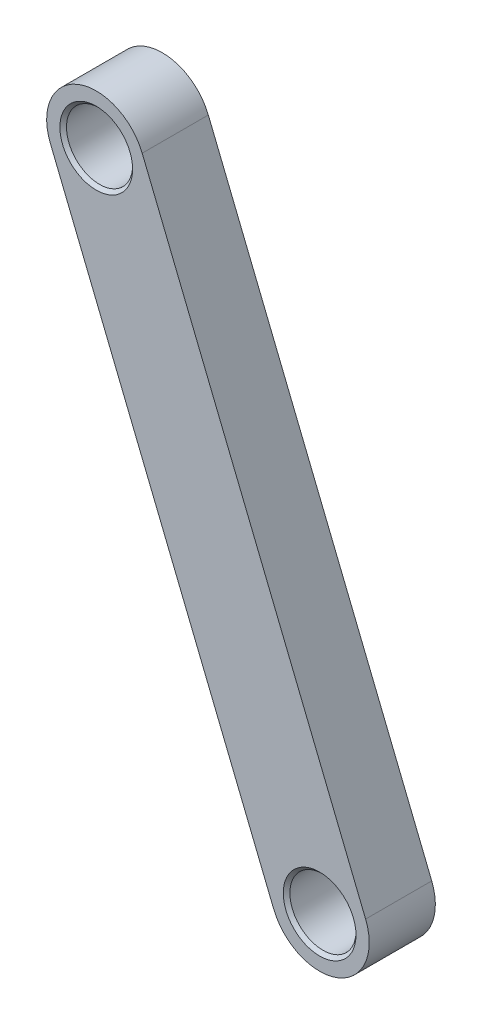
ISO-10303-21;
HEADER;
FILE_DESCRIPTION(('STEP AP214'),'2;1');
FILE_NAME('part.step','',(''),(''),'','','');
FILE_SCHEMA(('AUTOMOTIVE_DESIGN { 1 0 10303 214 1 1 1 1 }'));
ENDSEC;
DATA;
#1=APPLICATION_CONTEXT('core data for automotive mechanical design processes');
#2=APPLICATION_PROTOCOL_DEFINITION('international standard','automotive_design',2000,#1);
#3=PRODUCT_CONTEXT('',#1,'mechanical');
#4=PRODUCT('Part','Part','',(#3));
#5=PRODUCT_RELATED_PRODUCT_CATEGORY('part','',(#4));
#6=PRODUCT_DEFINITION_FORMATION('','',#4);
#7=PRODUCT_DEFINITION_CONTEXT('part definition',#1,'design');
#8=PRODUCT_DEFINITION('design','',#6,#7);
#9=PRODUCT_DEFINITION_SHAPE('','',#8);
#10=(LENGTH_UNIT() NAMED_UNIT(*) SI_UNIT(.MILLI.,.METRE.));
#11=(NAMED_UNIT(*) PLANE_ANGLE_UNIT() SI_UNIT($,.RADIAN.));
#12=(NAMED_UNIT(*) SI_UNIT($,.STERADIAN.) SOLID_ANGLE_UNIT());
#13=UNCERTAINTY_MEASURE_WITH_UNIT(LENGTH_MEASURE(1.E-05),#10,'distance_accuracy_value','');
#14=(GEOMETRIC_REPRESENTATION_CONTEXT(3) GLOBAL_UNCERTAINTY_ASSIGNED_CONTEXT((#13)) GLOBAL_UNIT_ASSIGNED_CONTEXT((#10,
#11,#12)) REPRESENTATION_CONTEXT('',''));
#15=CARTESIAN_POINT('',(0.,0.,0.));
#16=DIRECTION('',(0.,0.,1.));
#17=DIRECTION('',(1.,0.,0.));
#18=AXIS2_PLACEMENT_3D('',#15,#16,#17);
#19=CARTESIAN_POINT('',(61.7201647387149,127.884766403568,20.));
#20=DIRECTION('',(0.,0.,1.));
#21=DIRECTION('',(1.,0.,0.));
#22=AXIS2_PLACEMENT_3D('',#19,#20,#21);
#23=PLANE('',#22);
#24=CARTESIAN_POINT('',(-5.85208023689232,294.71998962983,20.));
#25=DIRECTION('',(0.,0.,1.));
#26=DIRECTION('',(1.,0.,0.));
#27=AXIS2_PLACEMENT_3D('',#24,#25,#26);
#28=CIRCLE('',#27,11.);
#29=CARTESIAN_POINT('',(5.14791976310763,294.71998962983,20.));
#30=VERTEX_POINT('',#29);
#31=EDGE_CURVE('E124',#30,#30,#28,.F.);
#32=ORIENTED_EDGE('',*,*,#31,.T.);
#33=EDGE_LOOP('',(#32));
#34=FACE_BOUND('',#33,.T.);
#35=CARTESIAN_POINT('',(61.7201647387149,127.884766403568,20.));
#36=DIRECTION('',(0.,0.,1.));
#37=DIRECTION('',(1.,0.,0.));
#38=AXIS2_PLACEMENT_3D('',#35,#36,#37);
#39=CIRCLE('',#38,11.);
#40=CARTESIAN_POINT('',(72.7201647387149,127.884766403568,20.));
#41=VERTEX_POINT('',#40);
#42=EDGE_CURVE('E121',#41,#41,#39,.F.);
#43=ORIENTED_EDGE('',*,*,#42,.T.);
#44=EDGE_LOOP('',(#43));
#45=FACE_BOUND('',#44,.T.);
#46=CARTESIAN_POINT('',(61.7201647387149,127.884766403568,20.));
#47=DIRECTION('',(0.,0.,1.));
#48=DIRECTION('',(1.,0.,0.));
#49=AXIS2_PLACEMENT_3D('',#46,#47,#48);
#50=CIRCLE('',#49,15.);
#51=CARTESIAN_POINT('',(47.8172294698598,122.253745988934,20.));
#52=VERTEX_POINT('',#51);
#53=CARTESIAN_POINT('',(75.62310000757,133.515786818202,20.));
#54=VERTEX_POINT('',#53);
#55=EDGE_CURVE('E85',#52,#54,#50,.T.);
#56=ORIENTED_EDGE('',*,*,#55,.T.);
#57=DIRECTION('',(-0.375401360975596,0.926862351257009,0.));
#58=VECTOR('',#57,1.);
#59=CARTESIAN_POINT('',(75.62310000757,133.515786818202,20.));
#60=LINE('',#59,#58);
#61=CARTESIAN_POINT('',(8.05085503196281,300.351010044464,20.));
#62=VERTEX_POINT('',#61);
#63=EDGE_CURVE('E81',#54,#62,#60,.T.);
#64=ORIENTED_EDGE('',*,*,#63,.T.);
#65=CARTESIAN_POINT('',(-5.85208023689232,294.71998962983,20.));
#66=DIRECTION('',(0.,0.,1.));
#67=DIRECTION('',(1.,0.,0.));
#68=AXIS2_PLACEMENT_3D('',#65,#66,#67);
#69=CIRCLE('',#68,15.);
#70=CARTESIAN_POINT('',(-19.7550155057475,289.088969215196,20.));
#71=VERTEX_POINT('',#70);
#72=EDGE_CURVE('E83',#62,#71,#69,.T.);
#73=ORIENTED_EDGE('',*,*,#72,.T.);
#74=DIRECTION('',(0.375401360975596,-0.926862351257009,0.));
#75=VECTOR('',#74,1.);
#76=CARTESIAN_POINT('',(47.8172294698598,122.253745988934,20.));
#77=LINE('',#76,#75);
#78=EDGE_CURVE('E50',#71,#52,#77,.T.);
#79=ORIENTED_EDGE('',*,*,#78,.T.);
#80=EDGE_LOOP('',(#56,#64,#73,#79));
#81=FACE_BOUND('',#80,.T.);
#82=ADVANCED_FACE('F33',(#34,#45,#81),#23,.T.);
#83=CARTESIAN_POINT('',(61.7201647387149,127.884766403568,0.));
#84=DIRECTION('',(0.,0.,1.));
#85=DIRECTION('',(1.,0.,0.));
#86=AXIS2_PLACEMENT_3D('',#83,#84,#85);
#87=PLANE('',#86);
#88=CARTESIAN_POINT('',(-5.85208023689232,294.71998962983,0.));
#89=DIRECTION('',(0.,0.,1.));
#90=DIRECTION('',(1.,0.,0.));
#91=AXIS2_PLACEMENT_3D('',#88,#89,#90);
#92=CIRCLE('',#91,11.);
#93=CARTESIAN_POINT('',(5.14791976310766,294.71998962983,0.));
#94=VERTEX_POINT('',#93);
#95=EDGE_CURVE('E112',#94,#94,#92,.T.);
#96=ORIENTED_EDGE('',*,*,#95,.T.);
#97=EDGE_LOOP('',(#96));
#98=FACE_BOUND('',#97,.T.);
#99=CARTESIAN_POINT('',(61.7201647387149,127.884766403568,0.));
#100=DIRECTION('',(0.,0.,1.));
#101=DIRECTION('',(1.,0.,0.));
#102=AXIS2_PLACEMENT_3D('',#99,#100,#101);
#103=CIRCLE('',#102,11.);
#104=CARTESIAN_POINT('',(72.7201647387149,127.884766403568,0.));
#105=VERTEX_POINT('',#104);
#106=EDGE_CURVE('E109',#105,#105,#103,.T.);
#107=ORIENTED_EDGE('',*,*,#106,.T.);
#108=EDGE_LOOP('',(#107));
#109=FACE_BOUND('',#108,.T.);
#110=CARTESIAN_POINT('',(61.7201647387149,127.884766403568,0.));
#111=DIRECTION('',(0.,0.,1.));
#112=DIRECTION('',(1.,0.,0.));
#113=AXIS2_PLACEMENT_3D('',#110,#111,#112);
#114=CIRCLE('',#113,15.);
#115=CARTESIAN_POINT('',(47.8172294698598,122.253745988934,0.));
#116=VERTEX_POINT('',#115);
#117=CARTESIAN_POINT('',(75.62310000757,133.515786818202,0.));
#118=VERTEX_POINT('',#117);
#119=EDGE_CURVE('E100',#116,#118,#114,.T.);
#120=ORIENTED_EDGE('',*,*,#119,.F.);
#121=DIRECTION('',(0.375401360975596,-0.926862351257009,0.));
#122=VECTOR('',#121,1.);
#123=CARTESIAN_POINT('',(47.8172294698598,122.253745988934,0.));
#124=LINE('',#123,#122);
#125=CARTESIAN_POINT('',(-19.7550155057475,289.088969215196,0.));
#126=VERTEX_POINT('',#125);
#127=EDGE_CURVE('E73',#126,#116,#124,.T.);
#128=ORIENTED_EDGE('',*,*,#127,.F.);
#129=CARTESIAN_POINT('',(-5.85208023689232,294.71998962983,0.));
#130=DIRECTION('',(0.,0.,1.));
#131=DIRECTION('',(1.,0.,0.));
#132=AXIS2_PLACEMENT_3D('',#129,#130,#131);
#133=CIRCLE('',#132,15.);
#134=CARTESIAN_POINT('',(8.05085503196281,300.351010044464,0.));
#135=VERTEX_POINT('',#134);
#136=EDGE_CURVE('E67',#135,#126,#133,.T.);
#137=ORIENTED_EDGE('',*,*,#136,.F.);
#138=DIRECTION('',(-0.375401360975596,0.926862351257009,0.));
#139=VECTOR('',#138,1.);
#140=CARTESIAN_POINT('',(75.62310000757,133.515786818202,0.));
#141=LINE('',#140,#139);
#142=EDGE_CURVE('E90',#118,#135,#141,.T.);
#143=ORIENTED_EDGE('',*,*,#142,.F.);
#144=EDGE_LOOP('',(#120,#128,#137,#143));
#145=FACE_BOUND('',#144,.T.);
#146=ADVANCED_FACE('F141',(#98,#109,#145),#87,.F.);
#147=CARTESIAN_POINT('',(61.7201647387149,127.884766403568,20.));
#148=DIRECTION('',(0.,0.,-1.));
#149=DIRECTION('',(-1.,0.,0.));
#150=AXIS2_PLACEMENT_3D('',#147,#148,#149);
#151=CYLINDRICAL_SURFACE('',#150,15.);
#152=ORIENTED_EDGE('',*,*,#119,.T.);
#153=DIRECTION('',(0.,0.,-1.));
#154=VECTOR('',#153,1.);
#155=CARTESIAN_POINT('',(75.62310000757,133.515786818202,20.));
#156=LINE('',#155,#154);
#157=EDGE_CURVE('E91',#54,#118,#156,.T.);
#158=ORIENTED_EDGE('',*,*,#157,.F.);
#159=ORIENTED_EDGE('',*,*,#55,.F.);
#160=DIRECTION('',(0.,0.,-1.));
#161=VECTOR('',#160,1.);
#162=CARTESIAN_POINT('',(47.8172294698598,122.253745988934,20.));
#163=LINE('',#162,#161);
#164=EDGE_CURVE('E96',#52,#116,#163,.T.);
#165=ORIENTED_EDGE('',*,*,#164,.T.);
#166=EDGE_LOOP('',(#152,#158,#159,#165));
#167=FACE_BOUND('',#166,.T.);
#168=ADVANCED_FACE('F147',(#167),#151,.T.);
#169=CARTESIAN_POINT('',(75.62310000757,133.515786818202,20.));
#170=DIRECTION('',(-0.926862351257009,-0.375401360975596,0.));
#171=DIRECTION('',(0.375401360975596,-0.926862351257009,0.));
#172=AXIS2_PLACEMENT_3D('',#169,#170,#171);
#173=PLANE('',#172);
#174=ORIENTED_EDGE('',*,*,#142,.T.);
#175=DIRECTION('',(0.,0.,-1.));
#176=VECTOR('',#175,1.);
#177=CARTESIAN_POINT('',(8.05085503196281,300.351010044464,20.));
#178=LINE('',#177,#176);
#179=EDGE_CURVE('E88',#62,#135,#178,.T.);
#180=ORIENTED_EDGE('',*,*,#179,.F.);
#181=ORIENTED_EDGE('',*,*,#63,.F.);
#182=ORIENTED_EDGE('',*,*,#157,.T.);
#183=EDGE_LOOP('',(#174,#180,#181,#182));
#184=FACE_BOUND('',#183,.T.);
#185=ADVANCED_FACE('F89',(#184),#173,.F.);
#186=CARTESIAN_POINT('',(-5.85208023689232,294.71998962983,20.));
#187=DIRECTION('',(0.,0.,-1.));
#188=DIRECTION('',(-1.,0.,0.));
#189=AXIS2_PLACEMENT_3D('',#186,#187,#188);
#190=CYLINDRICAL_SURFACE('',#189,15.);
#191=ORIENTED_EDGE('',*,*,#136,.T.);
#192=DIRECTION('',(0.,0.,-1.));
#193=VECTOR('',#192,1.);
#194=CARTESIAN_POINT('',(-19.7550155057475,289.088969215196,20.));
#195=LINE('',#194,#193);
#196=EDGE_CURVE('E92',#71,#126,#195,.T.);
#197=ORIENTED_EDGE('',*,*,#196,.F.);
#198=ORIENTED_EDGE('',*,*,#72,.F.);
#199=ORIENTED_EDGE('',*,*,#179,.T.);
#200=EDGE_LOOP('',(#191,#197,#198,#199));
#201=FACE_BOUND('',#200,.T.);
#202=ADVANCED_FACE('F94',(#201),#190,.T.);
#203=CARTESIAN_POINT('',(47.8172294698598,122.253745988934,20.));
#204=DIRECTION('',(0.926862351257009,0.375401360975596,0.));
#205=DIRECTION('',(-0.375401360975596,0.926862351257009,0.));
#206=AXIS2_PLACEMENT_3D('',#203,#204,#205);
#207=PLANE('',#206);
#208=ORIENTED_EDGE('',*,*,#127,.T.);
#209=ORIENTED_EDGE('',*,*,#164,.F.);
#210=ORIENTED_EDGE('',*,*,#78,.F.);
#211=ORIENTED_EDGE('',*,*,#196,.T.);
#212=EDGE_LOOP('',(#208,#209,#210,#211));
#213=FACE_BOUND('',#212,.T.);
#214=ADVANCED_FACE('F155',(#213),#207,.F.);
#215=CARTESIAN_POINT('',(-5.85208023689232,294.71998962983,20.));
#216=DIRECTION('',(0.,0.,-1.));
#217=DIRECTION('',(-1.,0.,0.));
#218=AXIS2_PLACEMENT_3D('',#215,#216,#217);
#219=CYLINDRICAL_SURFACE('',#218,10.);
#220=CARTESIAN_POINT('',(-5.85208023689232,294.71998962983,0.99999999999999));
#221=DIRECTION('',(0.,0.,1.));
#222=DIRECTION('',(1.,0.,0.));
#223=AXIS2_PLACEMENT_3D('',#220,#221,#222);
#224=CIRCLE('',#223,10.);
#225=CARTESIAN_POINT('',(4.14791976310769,294.71998962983,0.99999999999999));
#226=VERTEX_POINT('',#225);
#227=EDGE_CURVE('E118',#226,#226,#224,.F.);
#228=ORIENTED_EDGE('',*,*,#227,.T.);
#229=EDGE_LOOP('',(#228));
#230=FACE_BOUND('',#229,.T.);
#231=CARTESIAN_POINT('',(-5.85208023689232,294.71998962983,19.0000000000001));
#232=DIRECTION('',(0.,0.,1.));
#233=DIRECTION('',(1.,0.,0.));
#234=AXIS2_PLACEMENT_3D('',#231,#232,#233);
#235=CIRCLE('',#234,10.);
#236=CARTESIAN_POINT('',(4.14791976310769,294.71998962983,19.0000000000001));
#237=VERTEX_POINT('',#236);
#238=EDGE_CURVE('E115',#237,#237,#235,.T.);
#239=ORIENTED_EDGE('',*,*,#238,.T.);
#240=EDGE_LOOP('',(#239));
#241=FACE_BOUND('',#240,.T.);
#242=ADVANCED_FACE('F152',(#230,#241),#219,.F.);
#243=CARTESIAN_POINT('',(61.7201647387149,127.884766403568,20.));
#244=DIRECTION('',(0.,0.,-1.));
#245=DIRECTION('',(-1.,0.,0.));
#246=AXIS2_PLACEMENT_3D('',#243,#244,#245);
#247=CYLINDRICAL_SURFACE('',#246,10.);
#248=CARTESIAN_POINT('',(61.7201647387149,127.884766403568,0.999999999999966));
#249=DIRECTION('',(0.,0.,1.));
#250=DIRECTION('',(1.,0.,0.));
#251=AXIS2_PLACEMENT_3D('',#248,#249,#250);
#252=CIRCLE('',#251,10.);
#253=CARTESIAN_POINT('',(71.7201647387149,127.884766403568,0.999999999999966));
#254=VERTEX_POINT('',#253);
#255=EDGE_CURVE('E11',#254,#254,#252,.F.);
#256=ORIENTED_EDGE('',*,*,#255,.T.);
#257=EDGE_LOOP('',(#256));
#258=FACE_BOUND('',#257,.T.);
#259=CARTESIAN_POINT('',(61.7201647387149,127.884766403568,19.));
#260=DIRECTION('',(0.,0.,1.));
#261=DIRECTION('',(1.,0.,0.));
#262=AXIS2_PLACEMENT_3D('',#259,#260,#261);
#263=CIRCLE('',#262,10.);
#264=CARTESIAN_POINT('',(71.7201647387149,127.884766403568,19.));
#265=VERTEX_POINT('',#264);
#266=EDGE_CURVE('E42',#265,#265,#263,.T.);
#267=ORIENTED_EDGE('',*,*,#266,.T.);
#268=EDGE_LOOP('',(#267));
#269=FACE_BOUND('',#268,.T.);
#270=ADVANCED_FACE('F129',(#258,#269),#247,.F.);
#271=CARTESIAN_POINT('',(-5.85208023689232,294.71998962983,0.));
#272=DIRECTION('',(0.,0.,-1.));
#273=DIRECTION('',(-1.,0.,0.));
#274=AXIS2_PLACEMENT_3D('',#271,#272,#273);
#275=CONICAL_SURFACE('',#274,11.,0.785398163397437);
#276=ORIENTED_EDGE('',*,*,#227,.F.);
#277=EDGE_LOOP('',(#276));
#278=FACE_BOUND('',#277,.T.);
#279=ORIENTED_EDGE('',*,*,#95,.F.);
#280=EDGE_LOOP('',(#279));
#281=FACE_BOUND('',#280,.T.);
#282=ADVANCED_FACE('F165',(#278,#281),#275,.F.);
#283=CARTESIAN_POINT('',(-5.85208023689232,294.71998962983,19.0000000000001));
#284=DIRECTION('',(0.,0.,1.));
#285=DIRECTION('',(1.,0.,0.));
#286=AXIS2_PLACEMENT_3D('',#283,#284,#285);
#287=CONICAL_SURFACE('',#286,10.,0.785398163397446);
#288=ORIENTED_EDGE('',*,*,#31,.F.);
#289=EDGE_LOOP('',(#288));
#290=FACE_BOUND('',#289,.T.);
#291=ORIENTED_EDGE('',*,*,#238,.F.);
#292=EDGE_LOOP('',(#291));
#293=FACE_BOUND('',#292,.T.);
#294=ADVANCED_FACE('F137',(#290,#293),#287,.F.);
#295=CARTESIAN_POINT('',(61.7201647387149,127.884766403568,0.));
#296=DIRECTION('',(0.,0.,-1.));
#297=DIRECTION('',(-1.,0.,0.));
#298=AXIS2_PLACEMENT_3D('',#295,#296,#297);
#299=CONICAL_SURFACE('',#298,11.,0.785398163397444);
#300=ORIENTED_EDGE('',*,*,#255,.F.);
#301=EDGE_LOOP('',(#300));
#302=FACE_BOUND('',#301,.T.);
#303=ORIENTED_EDGE('',*,*,#106,.F.);
#304=EDGE_LOOP('',(#303));
#305=FACE_BOUND('',#304,.T.);
#306=ADVANCED_FACE('F132',(#302,#305),#299,.F.);
#307=CARTESIAN_POINT('',(61.7201647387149,127.884766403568,19.));
#308=DIRECTION('',(0.,0.,1.));
#309=DIRECTION('',(1.,0.,0.));
#310=AXIS2_PLACEMENT_3D('',#307,#308,#309);
#311=CONICAL_SURFACE('',#310,10.,0.785398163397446);
#312=ORIENTED_EDGE('',*,*,#42,.F.);
#313=EDGE_LOOP('',(#312));
#314=FACE_BOUND('',#313,.T.);
#315=ORIENTED_EDGE('',*,*,#266,.F.);
#316=EDGE_LOOP('',(#315));
#317=FACE_BOUND('',#316,.T.);
#318=ADVANCED_FACE('F35',(#314,#317),#311,.F.);
#319=CLOSED_SHELL('',(#82,#146,#168,#185,#202,#214,#242,#270,#282,#294,#306,#318));
#320=MANIFOLD_SOLID_BREP('B2',#319);
#321=ADVANCED_BREP_SHAPE_REPRESENTATION('',(#18,#320),#14);
#322=SHAPE_DEFINITION_REPRESENTATION(#9,#321);
ENDSEC;
END-ISO-10303-21;
